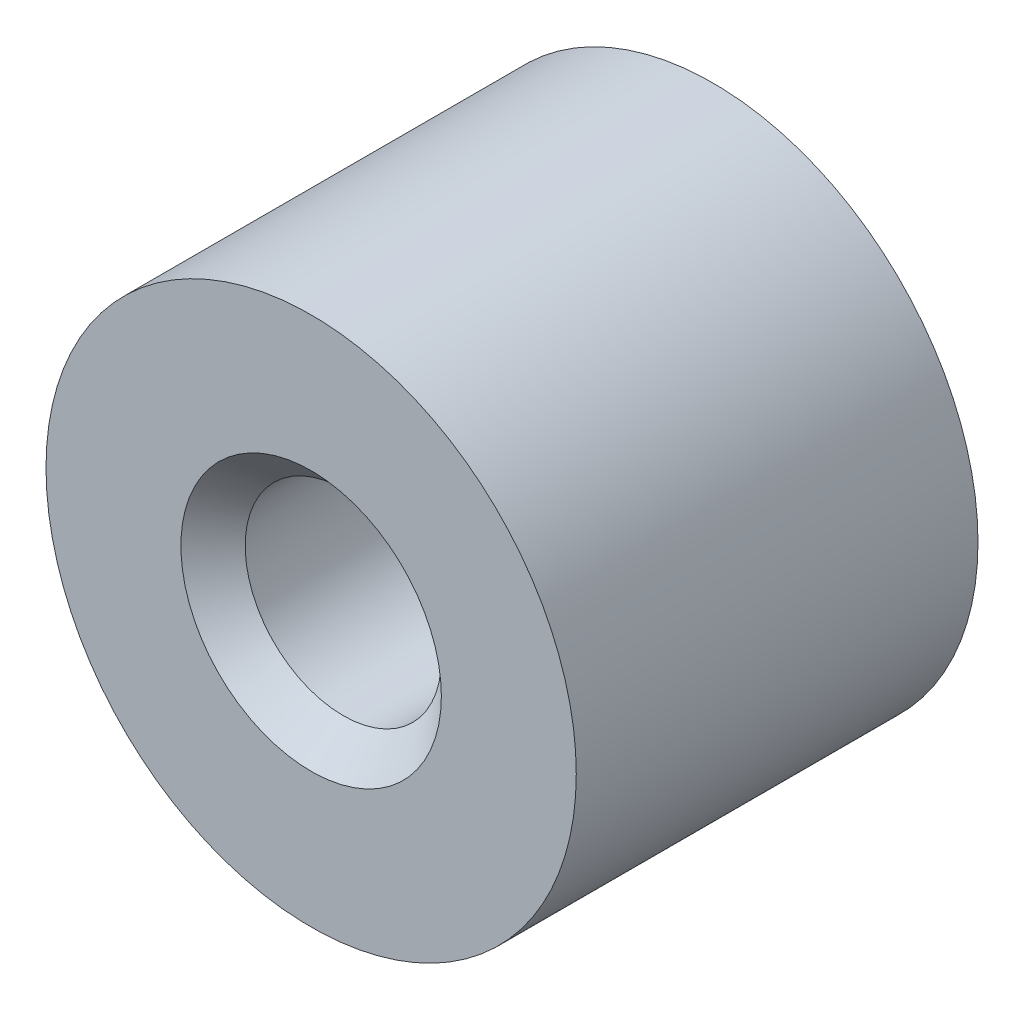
ISO-10303-21;
HEADER;
FILE_DESCRIPTION(('STEP AP214'),'2;1');
FILE_NAME('part.step','',(''),(''),'','','');
FILE_SCHEMA(('AUTOMOTIVE_DESIGN { 1 0 10303 214 1 1 1 1 }'));
ENDSEC;
DATA;
#1=APPLICATION_CONTEXT('core data for automotive mechanical design processes');
#2=APPLICATION_PROTOCOL_DEFINITION('international standard','automotive_design',2000,#1);
#3=PRODUCT_CONTEXT('',#1,'mechanical');
#4=PRODUCT('Part','Part','',(#3));
#5=PRODUCT_RELATED_PRODUCT_CATEGORY('part','',(#4));
#6=PRODUCT_DEFINITION_FORMATION('','',#4);
#7=PRODUCT_DEFINITION_CONTEXT('part definition',#1,'design');
#8=PRODUCT_DEFINITION('design','',#6,#7);
#9=PRODUCT_DEFINITION_SHAPE('','',#8);
#10=(LENGTH_UNIT() NAMED_UNIT(*) SI_UNIT(.MILLI.,.METRE.));
#11=(NAMED_UNIT(*) PLANE_ANGLE_UNIT() SI_UNIT($,.RADIAN.));
#12=(NAMED_UNIT(*) SI_UNIT($,.STERADIAN.) SOLID_ANGLE_UNIT());
#13=UNCERTAINTY_MEASURE_WITH_UNIT(LENGTH_MEASURE(1.E-05),#10,'distance_accuracy_value','');
#14=(GEOMETRIC_REPRESENTATION_CONTEXT(3) GLOBAL_UNCERTAINTY_ASSIGNED_CONTEXT((#13)) GLOBAL_UNIT_ASSIGNED_CONTEXT((#10,
#11,#12)) REPRESENTATION_CONTEXT('',''));
#15=CARTESIAN_POINT('',(0.,0.,0.));
#16=DIRECTION('',(0.,0.,1.));
#17=DIRECTION('',(1.,0.,0.));
#18=AXIS2_PLACEMENT_3D('',#15,#16,#17);
#19=CARTESIAN_POINT('',(0.,0.,-0.5));
#20=DIRECTION('',(0.,0.,1.));
#21=DIRECTION('',(1.,0.,0.));
#22=AXIS2_PLACEMENT_3D('',#19,#20,#21);
#23=PLANE('',#22);
#24=CARTESIAN_POINT('',(0.,0.,-0.5));
#25=DIRECTION('',(0.,0.,1.));
#26=DIRECTION('',(1.,0.,0.));
#27=AXIS2_PLACEMENT_3D('',#24,#25,#26);
#28=CIRCLE('',#27,0.4);
#29=CARTESIAN_POINT('',(0.4,0.,-0.5));
#30=VERTEX_POINT('',#29);
#31=EDGE_CURVE('E26',#30,#30,#28,.T.);
#32=ORIENTED_EDGE('',*,*,#31,.F.);
#33=EDGE_LOOP('',(#32));
#34=FACE_BOUND('',#33,.T.);
#35=ADVANCED_FACE('F17',(#34),#23,.F.);
#36=CARTESIAN_POINT('',(0.,0.,-0.5));
#37=DIRECTION('',(0.,0.,1.));
#38=DIRECTION('',(1.,0.,0.));
#39=AXIS2_PLACEMENT_3D('',#36,#37,#38);
#40=CYLINDRICAL_SURFACE('',#39,0.4);
#41=ORIENTED_EDGE('',*,*,#31,.T.);
#42=CARTESIAN_POINT('',(0.4,0.,-0.5));
#43=CARTESIAN_POINT('',(0.4,0.,0.));
#44=(BOUNDED_CURVE() B_SPLINE_CURVE(1,(#42,#43),.UNSPECIFIED.,.F.,
.F.) B_SPLINE_CURVE_WITH_KNOTS((2,2),(0.,0.5),
.UNSPECIFIED.) CURVE() GEOMETRIC_REPRESENTATION_ITEM() RATIONAL_B_SPLINE_CURVE((1.,1.)) REPRESENTATION_ITEM(''));
#45=CARTESIAN_POINT('',(0.4,0.,0.));
#46=VERTEX_POINT('',#45);
#47=EDGE_CURVE('E11',#30,#46,#44,.T.);
#48=ORIENTED_EDGE('',*,*,#47,.T.);
#49=CARTESIAN_POINT('',(0.,0.,0.));
#50=DIRECTION('',(0.,0.,1.));
#51=DIRECTION('',(1.,0.,0.));
#52=AXIS2_PLACEMENT_3D('',#49,#50,#51);
#53=CIRCLE('',#52,0.4);
#54=EDGE_CURVE('E88',#46,#46,#53,.T.);
#55=ORIENTED_EDGE('',*,*,#54,.F.);
#56=ORIENTED_EDGE('',*,*,#47,.F.);
#57=EDGE_LOOP('',(#41,#48,#55,#56));
#58=FACE_BOUND('',#57,.T.);
#59=ADVANCED_FACE('F182',(#58),#40,.T.);
#60=CARTESIAN_POINT('',(0.,0.,0.866825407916));
#61=DIRECTION('',(0.,0.,1.));
#62=DIRECTION('',(0.,1.,0.));
#63=AXIS2_PLACEMENT_3D('',#60,#61,#62);
#64=CONICAL_SURFACE('',#63,0.6105,1.029744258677);
#65=CARTESIAN_POINT('',(0.,0.,0.499999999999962));
#66=VERTEX_POINT('',#65);
#67=VERTEX_LOOP('',#66);
#68=FACE_BOUND('',#67,.T.);
#69=CARTESIAN_POINT('',(0.,0.,0.866825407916));
#70=DIRECTION('',(0.,0.,-1.));
#71=DIRECTION('',(0.,1.,0.));
#72=AXIS2_PLACEMENT_3D('',#69,#70,#71);
#73=CIRCLE('',#72,0.6105);
#74=CARTESIAN_POINT('',(0.,0.6105,0.866825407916));
#75=VERTEX_POINT('',#74);
#76=CARTESIAN_POINT('',(0.,-0.6105,0.866825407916));
#77=VERTEX_POINT('',#76);
#78=EDGE_CURVE('E83',#75,#77,#73,.T.);
#79=ORIENTED_EDGE('',*,*,#78,.F.);
#80=CARTESIAN_POINT('',(0.,0.,0.866825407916));
#81=DIRECTION('',(0.,0.,-1.));
#82=DIRECTION('',(0.,1.,0.));
#83=AXIS2_PLACEMENT_3D('',#80,#81,#82);
#84=CIRCLE('',#83,0.6105);
#85=EDGE_CURVE('E79',#77,#75,#84,.T.);
#86=ORIENTED_EDGE('',*,*,#85,.F.);
#87=EDGE_LOOP('',(#79,#86));
#88=FACE_BOUND('',#87,.T.);
#89=ADVANCED_FACE('F91',(#68,#88),#64,.F.);
#90=CARTESIAN_POINT('',(0.,0.,2.5));
#91=DIRECTION('',(0.,0.,1.));
#92=DIRECTION('',(1.,0.,0.));
#93=AXIS2_PLACEMENT_3D('',#90,#91,#92);
#94=CONICAL_SURFACE('',#93,0.8105,0.785398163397);
#95=CARTESIAN_POINT('',(0.,0.,2.3));
#96=DIRECTION('',(0.,0.,1.));
#97=DIRECTION('',(1.,0.,0.));
#98=AXIS2_PLACEMENT_3D('',#95,#96,#97);
#99=CIRCLE('',#98,0.6105);
#100=CARTESIAN_POINT('',(0.6105,0.,2.3));
#101=VERTEX_POINT('',#100);
#102=CARTESIAN_POINT('',(0.,-0.6105,2.3));
#103=VERTEX_POINT('',#102);
#104=EDGE_CURVE('E20',#101,#103,#99,.T.);
#105=ORIENTED_EDGE('',*,*,#104,.F.);
#106=CARTESIAN_POINT('',(0.6105,0.,2.3));
#107=CARTESIAN_POINT('',(0.8105,0.,2.5));
#108=(BOUNDED_CURVE() B_SPLINE_CURVE(1,(#106,#107),.UNSPECIFIED.,.F.,
.F.) B_SPLINE_CURVE_WITH_KNOTS((2,2),(-0.282842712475,0.),
.UNSPECIFIED.) CURVE() GEOMETRIC_REPRESENTATION_ITEM() RATIONAL_B_SPLINE_CURVE((1.,1.)) REPRESENTATION_ITEM(''));
#109=CARTESIAN_POINT('',(0.8105,0.,2.5));
#110=VERTEX_POINT('',#109);
#111=EDGE_CURVE('E126',#101,#110,#108,.T.);
#112=ORIENTED_EDGE('',*,*,#111,.T.);
#113=CARTESIAN_POINT('',(0.,0.,2.5));
#114=DIRECTION('',(0.,0.,-1.));
#115=DIRECTION('',(1.,0.,0.));
#116=AXIS2_PLACEMENT_3D('',#113,#114,#115);
#117=CIRCLE('',#116,0.8105);
#118=EDGE_CURVE('E131',#110,#110,#117,.T.);
#119=ORIENTED_EDGE('',*,*,#118,.F.);
#120=ORIENTED_EDGE('',*,*,#111,.F.);
#121=CARTESIAN_POINT('',(0.,0.,2.3));
#122=DIRECTION('',(0.,0.,1.));
#123=DIRECTION('',(1.,0.,0.));
#124=AXIS2_PLACEMENT_3D('',#121,#122,#123);
#125=CIRCLE('',#124,0.6105);
#126=EDGE_CURVE('E144',#103,#101,#125,.T.);
#127=ORIENTED_EDGE('',*,*,#126,.F.);
#128=EDGE_LOOP('',(#105,#112,#119,#120,#127));
#129=FACE_BOUND('',#128,.T.);
#130=ADVANCED_FACE('F161',(#129),#94,.F.);
#131=CARTESIAN_POINT('',(0.,0.,2.5));
#132=DIRECTION('',(0.,0.,-1.));
#133=DIRECTION('',(0.,-1.,0.));
#134=AXIS2_PLACEMENT_3D('',#131,#132,#133);
#135=CYLINDRICAL_SURFACE('',#134,0.6105);
#136=CARTESIAN_POINT('',(0.,-0.6105,2.3));
#137=CARTESIAN_POINT('',(0.,-0.6105,1.));
#138=(BOUNDED_CURVE() B_SPLINE_CURVE(1,(#136,#137),.UNSPECIFIED.,.F.,
.F.) B_SPLINE_CURVE_WITH_KNOTS((2,2),(0.2,1.5),
.UNSPECIFIED.) CURVE() GEOMETRIC_REPRESENTATION_ITEM() RATIONAL_B_SPLINE_CURVE((1.,1.)) REPRESENTATION_ITEM(''));
#139=CARTESIAN_POINT('',(0.,-0.6105,1.));
#140=VERTEX_POINT('',#139);
#141=EDGE_CURVE('E138',#103,#140,#138,.T.);
#142=ORIENTED_EDGE('',*,*,#141,.F.);
#143=ORIENTED_EDGE('',*,*,#126,.T.);
#144=ORIENTED_EDGE('',*,*,#104,.T.);
#145=ORIENTED_EDGE('',*,*,#141,.T.);
#146=CARTESIAN_POINT('',(0.,0.,1.));
#147=DIRECTION('',(0.,0.,1.));
#148=DIRECTION('',(0.,-1.,0.));
#149=AXIS2_PLACEMENT_3D('',#146,#147,#148);
#150=CIRCLE('',#149,0.6105);
#151=EDGE_CURVE('E89',#140,#140,#150,.T.);
#152=ORIENTED_EDGE('',*,*,#151,.F.);
#153=EDGE_LOOP('',(#142,#143,#144,#145,#152));
#154=FACE_BOUND('',#153,.T.);
#155=ADVANCED_FACE('F158',(#154),#135,.F.);
#156=CARTESIAN_POINT('',(-1.65,0.,2.5));
#157=DIRECTION('',(0.,0.,1.));
#158=DIRECTION('',(1.,0.,0.));
#159=AXIS2_PLACEMENT_3D('',#156,#157,#158);
#160=PLANE('',#159);
#161=CARTESIAN_POINT('',(0.,0.,2.5));
#162=DIRECTION('',(0.,0.,-1.));
#163=DIRECTION('',(-1.,0.,0.));
#164=AXIS2_PLACEMENT_3D('',#161,#162,#163);
#165=CIRCLE('',#164,1.65);
#166=CARTESIAN_POINT('',(-1.65,0.,2.5));
#167=VERTEX_POINT('',#166);
#168=EDGE_CURVE('E119',#167,#167,#165,.T.);
#169=ORIENTED_EDGE('',*,*,#168,.F.);
#170=EDGE_LOOP('',(#169));
#171=FACE_BOUND('',#170,.T.);
#172=ORIENTED_EDGE('',*,*,#118,.T.);
#173=EDGE_LOOP('',(#172));
#174=FACE_BOUND('',#173,.T.);
#175=ADVANCED_FACE('F164',(#171,#174),#160,.T.);
#176=CARTESIAN_POINT('',(0.,0.,4.));
#177=DIRECTION('',(0.,0.,-1.));
#178=DIRECTION('',(-1.,0.,0.));
#179=AXIS2_PLACEMENT_3D('',#176,#177,#178);
#180=CYLINDRICAL_SURFACE('',#179,1.65);
#181=ORIENTED_EDGE('',*,*,#168,.T.);
#182=CARTESIAN_POINT('',(-1.65,0.,2.5));
#183=CARTESIAN_POINT('',(-1.65,0.,0.));
#184=(BOUNDED_CURVE() B_SPLINE_CURVE(1,(#182,#183),.UNSPECIFIED.,.F.,
.F.) B_SPLINE_CURVE_WITH_KNOTS((2,2),(1.5,4.),
.UNSPECIFIED.) CURVE() GEOMETRIC_REPRESENTATION_ITEM() RATIONAL_B_SPLINE_CURVE((1.,1.)) REPRESENTATION_ITEM(''));
#185=CARTESIAN_POINT('',(-1.65,0.,0.));
#186=VERTEX_POINT('',#185);
#187=EDGE_CURVE('E99',#167,#186,#184,.T.);
#188=ORIENTED_EDGE('',*,*,#187,.T.);
#189=CARTESIAN_POINT('',(0.,0.,0.));
#190=DIRECTION('',(0.,0.,-1.));
#191=DIRECTION('',(-1.,0.,0.));
#192=AXIS2_PLACEMENT_3D('',#189,#190,#191);
#193=CIRCLE('',#192,1.65);
#194=EDGE_CURVE('E116',#186,#186,#193,.T.);
#195=ORIENTED_EDGE('',*,*,#194,.F.);
#196=ORIENTED_EDGE('',*,*,#187,.F.);
#197=EDGE_LOOP('',(#181,#188,#195,#196));
#198=FACE_BOUND('',#197,.T.);
#199=ADVANCED_FACE('F166',(#198),#180,.T.);
#200=CARTESIAN_POINT('',(0.,0.,0.));
#201=DIRECTION('',(0.,0.,-1.));
#202=DIRECTION('',(0.,-1.,0.));
#203=AXIS2_PLACEMENT_3D('',#200,#201,#202);
#204=PLANE('',#203);
#205=ORIENTED_EDGE('',*,*,#194,.T.);
#206=EDGE_LOOP('',(#205));
#207=FACE_BOUND('',#206,.T.);
#208=ORIENTED_EDGE('',*,*,#54,.T.);
#209=EDGE_LOOP('',(#208));
#210=FACE_BOUND('',#209,.T.);
#211=ADVANCED_FACE('F175',(#207,#210),#204,.T.);
#212=CARTESIAN_POINT('',(0.,0.,2.5));
#213=DIRECTION('',(0.,0.,-1.));
#214=DIRECTION('',(0.,-1.,0.));
#215=AXIS2_PLACEMENT_3D('',#212,#213,#214);
#216=CYLINDRICAL_SURFACE('',#215,0.6105);
#217=ORIENTED_EDGE('',*,*,#78,.T.);
#218=CARTESIAN_POINT('',(0.,-0.6105,1.));
#219=CARTESIAN_POINT('',(0.,-0.6105,0.866825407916));
#220=(BOUNDED_CURVE() B_SPLINE_CURVE(1,(#218,#219),.UNSPECIFIED.,.F.,
.F.) B_SPLINE_CURVE_WITH_KNOTS((2,2),(1.5,1.633174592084),
.UNSPECIFIED.) CURVE() GEOMETRIC_REPRESENTATION_ITEM() RATIONAL_B_SPLINE_CURVE((1.,1.)) REPRESENTATION_ITEM(''));
#221=EDGE_CURVE('E85',#140,#77,#220,.T.);
#222=ORIENTED_EDGE('',*,*,#221,.F.);
#223=ORIENTED_EDGE('',*,*,#151,.T.);
#224=ORIENTED_EDGE('',*,*,#221,.T.);
#225=ORIENTED_EDGE('',*,*,#85,.T.);
#226=EDGE_LOOP('',(#217,#222,#223,#224,#225));
#227=FACE_BOUND('',#226,.T.);
#228=ADVANCED_FACE('F81',(#227),#216,.F.);
#229=CLOSED_SHELL('',(#35,#59,#89,#130,#155,#175,#199,#211,#228));
#230=MANIFOLD_SOLID_BREP('B1',#229);
#231=ADVANCED_BREP_SHAPE_REPRESENTATION('',(#18,#230),#14);
#232=SHAPE_DEFINITION_REPRESENTATION(#9,#231);
ENDSEC;
END-ISO-10303-21;
